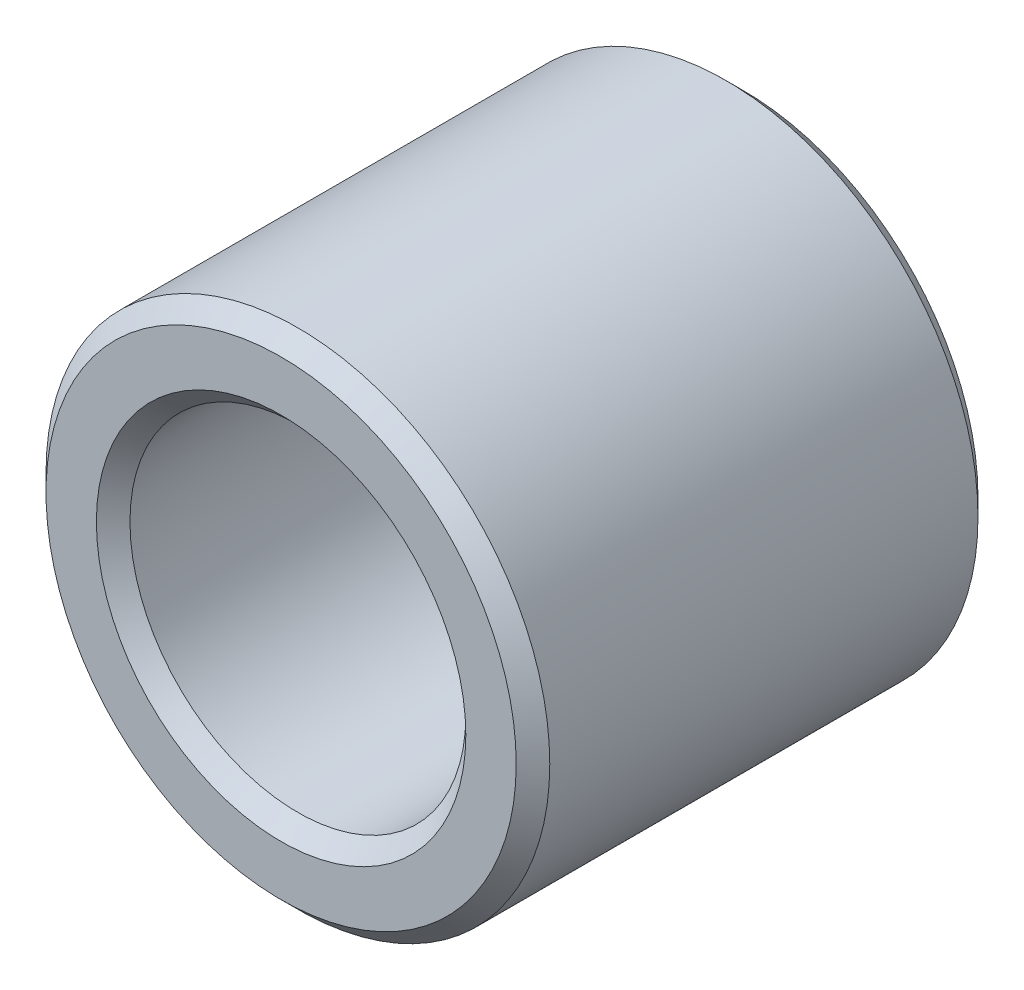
ISO-10303-21;
HEADER;
FILE_DESCRIPTION(('STEP AP214'),'2;1');
FILE_NAME('part.step','',(''),(''),'','','');
FILE_SCHEMA(('AUTOMOTIVE_DESIGN { 1 0 10303 214 1 1 1 1 }'));
ENDSEC;
DATA;
#1=APPLICATION_CONTEXT('core data for automotive mechanical design processes');
#2=APPLICATION_PROTOCOL_DEFINITION('international standard','automotive_design',2000,#1);
#3=PRODUCT_CONTEXT('',#1,'mechanical');
#4=PRODUCT('Part','Part','',(#3));
#5=PRODUCT_RELATED_PRODUCT_CATEGORY('part','',(#4));
#6=PRODUCT_DEFINITION_FORMATION('','',#4);
#7=PRODUCT_DEFINITION_CONTEXT('part definition',#1,'design');
#8=PRODUCT_DEFINITION('design','',#6,#7);
#9=PRODUCT_DEFINITION_SHAPE('','',#8);
#10=(LENGTH_UNIT() NAMED_UNIT(*) SI_UNIT(.MILLI.,.METRE.));
#11=(NAMED_UNIT(*) PLANE_ANGLE_UNIT() SI_UNIT($,.RADIAN.));
#12=(NAMED_UNIT(*) SI_UNIT($,.STERADIAN.) SOLID_ANGLE_UNIT());
#13=UNCERTAINTY_MEASURE_WITH_UNIT(LENGTH_MEASURE(1.E-05),#10,'distance_accuracy_value','');
#14=(GEOMETRIC_REPRESENTATION_CONTEXT(3) GLOBAL_UNCERTAINTY_ASSIGNED_CONTEXT((#13)) GLOBAL_UNIT_ASSIGNED_CONTEXT((#10,
#11,#12)) REPRESENTATION_CONTEXT('',''));
#15=CARTESIAN_POINT('',(0.,0.,0.));
#16=DIRECTION('',(0.,0.,1.));
#17=DIRECTION('',(1.,0.,0.));
#18=AXIS2_PLACEMENT_3D('',#15,#16,#17);
#19=CARTESIAN_POINT('',(0.,0.,55.));
#20=DIRECTION('',(0.,0.,1.));
#21=DIRECTION('',(1.,0.,0.));
#22=AXIS2_PLACEMENT_3D('',#19,#20,#21);
#23=PLANE('',#22);
#24=CARTESIAN_POINT('',(0.,0.,55.));
#25=DIRECTION('',(0.,0.,1.));
#26=DIRECTION('',(1.,0.,0.));
#27=AXIS2_PLACEMENT_3D('',#24,#25,#26);
#28=CIRCLE('',#27,44.);
#29=CARTESIAN_POINT('',(44.,0.,55.));
#30=VERTEX_POINT('',#29);
#31=EDGE_CURVE('E10',#30,#30,#28,.F.);
#32=ORIENTED_EDGE('',*,*,#31,.T.);
#33=EDGE_LOOP('',(#32));
#34=FACE_BOUND('',#33,.T.);
#35=CARTESIAN_POINT('',(0.,0.,55.));
#36=DIRECTION('',(0.,0.,1.));
#37=DIRECTION('',(1.,0.,0.));
#38=AXIS2_PLACEMENT_3D('',#35,#36,#37);
#39=CIRCLE('',#38,56.);
#40=CARTESIAN_POINT('',(56.,0.,55.));
#41=VERTEX_POINT('',#40);
#42=EDGE_CURVE('E45',#41,#41,#39,.T.);
#43=ORIENTED_EDGE('',*,*,#42,.T.);
#44=EDGE_LOOP('',(#43));
#45=FACE_BOUND('',#44,.T.);
#46=ADVANCED_FACE('F37',(#34,#45),#23,.T.);
#47=CARTESIAN_POINT('',(0.,0.,-55.));
#48=DIRECTION('',(0.,0.,1.));
#49=DIRECTION('',(1.,0.,0.));
#50=AXIS2_PLACEMENT_3D('',#47,#48,#49);
#51=PLANE('',#50);
#52=CARTESIAN_POINT('',(0.,0.,-55.));
#53=DIRECTION('',(0.,0.,1.));
#54=DIRECTION('',(1.,0.,0.));
#55=AXIS2_PLACEMENT_3D('',#52,#53,#54);
#56=CIRCLE('',#55,44.);
#57=CARTESIAN_POINT('',(44.,0.,-55.));
#58=VERTEX_POINT('',#57);
#59=EDGE_CURVE('E69',#58,#58,#56,.T.);
#60=ORIENTED_EDGE('',*,*,#59,.T.);
#61=EDGE_LOOP('',(#60));
#62=FACE_BOUND('',#61,.T.);
#63=CARTESIAN_POINT('',(0.,0.,-55.));
#64=DIRECTION('',(0.,0.,1.));
#65=DIRECTION('',(1.,0.,0.));
#66=AXIS2_PLACEMENT_3D('',#63,#64,#65);
#67=CIRCLE('',#66,56.);
#68=CARTESIAN_POINT('',(56.,0.,-55.));
#69=VERTEX_POINT('',#68);
#70=EDGE_CURVE('E73',#69,#69,#67,.F.);
#71=ORIENTED_EDGE('',*,*,#70,.T.);
#72=EDGE_LOOP('',(#71));
#73=FACE_BOUND('',#72,.T.);
#74=ADVANCED_FACE('F78',(#62,#73),#51,.F.);
#75=CARTESIAN_POINT('',(0.,0.,55.));
#76=DIRECTION('',(0.,0.,-1.));
#77=DIRECTION('',(-1.,0.,0.));
#78=AXIS2_PLACEMENT_3D('',#75,#76,#77);
#79=CYLINDRICAL_SURFACE('',#78,60.);
#80=CARTESIAN_POINT('',(0.,0.,-51.));
#81=DIRECTION('',(0.,0.,1.));
#82=DIRECTION('',(1.,0.,0.));
#83=AXIS2_PLACEMENT_3D('',#80,#81,#82);
#84=CIRCLE('',#83,60.);
#85=CARTESIAN_POINT('',(60.,0.,-51.));
#86=VERTEX_POINT('',#85);
#87=EDGE_CURVE('E52',#86,#86,#84,.T.);
#88=ORIENTED_EDGE('',*,*,#87,.T.);
#89=EDGE_LOOP('',(#88));
#90=FACE_BOUND('',#89,.T.);
#91=CARTESIAN_POINT('',(0.,0.,51.));
#92=DIRECTION('',(0.,0.,1.));
#93=DIRECTION('',(1.,0.,0.));
#94=AXIS2_PLACEMENT_3D('',#91,#92,#93);
#95=CIRCLE('',#94,60.);
#96=CARTESIAN_POINT('',(60.,0.,51.));
#97=VERTEX_POINT('',#96);
#98=EDGE_CURVE('E58',#97,#97,#95,.F.);
#99=ORIENTED_EDGE('',*,*,#98,.T.);
#100=EDGE_LOOP('',(#99));
#101=FACE_BOUND('',#100,.T.);
#102=ADVANCED_FACE('F88',(#90,#101),#79,.T.);
#103=CARTESIAN_POINT('',(0.,0.,55.));
#104=DIRECTION('',(0.,0.,-1.));
#105=DIRECTION('',(-1.,0.,0.));
#106=AXIS2_PLACEMENT_3D('',#103,#104,#105);
#107=CYLINDRICAL_SURFACE('',#106,40.);
#108=CARTESIAN_POINT('',(0.,0.,-51.));
#109=DIRECTION('',(0.,0.,1.));
#110=DIRECTION('',(1.,0.,0.));
#111=AXIS2_PLACEMENT_3D('',#108,#109,#110);
#112=CIRCLE('',#111,40.);
#113=CARTESIAN_POINT('',(40.,0.,-51.));
#114=VERTEX_POINT('',#113);
#115=EDGE_CURVE('E63',#114,#114,#112,.F.);
#116=ORIENTED_EDGE('',*,*,#115,.T.);
#117=EDGE_LOOP('',(#116));
#118=FACE_BOUND('',#117,.T.);
#119=CARTESIAN_POINT('',(0.,0.,51.));
#120=DIRECTION('',(0.,0.,1.));
#121=DIRECTION('',(1.,0.,0.));
#122=AXIS2_PLACEMENT_3D('',#119,#120,#121);
#123=CIRCLE('',#122,40.);
#124=CARTESIAN_POINT('',(40.,0.,51.));
#125=VERTEX_POINT('',#124);
#126=EDGE_CURVE('E66',#125,#125,#123,.T.);
#127=ORIENTED_EDGE('',*,*,#126,.T.);
#128=EDGE_LOOP('',(#127));
#129=FACE_BOUND('',#128,.T.);
#130=ADVANCED_FACE('F91',(#118,#129),#107,.F.);
#131=CARTESIAN_POINT('',(0.,0.,-55.));
#132=DIRECTION('',(0.,0.,-1.));
#133=DIRECTION('',(-1.,0.,0.));
#134=AXIS2_PLACEMENT_3D('',#131,#132,#133);
#135=CONICAL_SURFACE('',#134,44.,0.785398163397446);
#136=ORIENTED_EDGE('',*,*,#115,.F.);
#137=EDGE_LOOP('',(#136));
#138=FACE_BOUND('',#137,.T.);
#139=ORIENTED_EDGE('',*,*,#59,.F.);
#140=EDGE_LOOP('',(#139));
#141=FACE_BOUND('',#140,.T.);
#142=ADVANCED_FACE('F84',(#138,#141),#135,.F.);
#143=CARTESIAN_POINT('',(0.,0.,-51.));
#144=DIRECTION('',(0.,0.,1.));
#145=DIRECTION('',(1.,0.,0.));
#146=AXIS2_PLACEMENT_3D('',#143,#144,#145);
#147=CONICAL_SURFACE('',#146,60.,0.785398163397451);
#148=ORIENTED_EDGE('',*,*,#70,.F.);
#149=EDGE_LOOP('',(#148));
#150=FACE_BOUND('',#149,.T.);
#151=ORIENTED_EDGE('',*,*,#87,.F.);
#152=EDGE_LOOP('',(#151));
#153=FACE_BOUND('',#152,.T.);
#154=ADVANCED_FACE('F80',(#150,#153),#147,.T.);
#155=CARTESIAN_POINT('',(0.,0.,51.));
#156=DIRECTION('',(0.,0.,1.));
#157=DIRECTION('',(1.,0.,0.));
#158=AXIS2_PLACEMENT_3D('',#155,#156,#157);
#159=CONICAL_SURFACE('',#158,40.,0.785398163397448);
#160=ORIENTED_EDGE('',*,*,#31,.F.);
#161=EDGE_LOOP('',(#160));
#162=FACE_BOUND('',#161,.T.);
#163=ORIENTED_EDGE('',*,*,#126,.F.);
#164=EDGE_LOOP('',(#163));
#165=FACE_BOUND('',#164,.T.);
#166=ADVANCED_FACE('F83',(#162,#165),#159,.F.);
#167=CARTESIAN_POINT('',(0.,0.,55.));
#168=DIRECTION('',(0.,0.,-1.));
#169=DIRECTION('',(-1.,0.,0.));
#170=AXIS2_PLACEMENT_3D('',#167,#168,#169);
#171=CONICAL_SURFACE('',#170,56.,0.785398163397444);
#172=ORIENTED_EDGE('',*,*,#98,.F.);
#173=EDGE_LOOP('',(#172));
#174=FACE_BOUND('',#173,.T.);
#175=ORIENTED_EDGE('',*,*,#42,.F.);
#176=EDGE_LOOP('',(#175));
#177=FACE_BOUND('',#176,.T.);
#178=ADVANCED_FACE('F39',(#174,#177),#171,.T.);
#179=CLOSED_SHELL('',(#46,#74,#102,#130,#142,#154,#166,#178));
#180=MANIFOLD_SOLID_BREP('B2',#179);
#181=ADVANCED_BREP_SHAPE_REPRESENTATION('',(#18,#180),#14);
#182=SHAPE_DEFINITION_REPRESENTATION(#9,#181);
ENDSEC;
END-ISO-10303-21;
